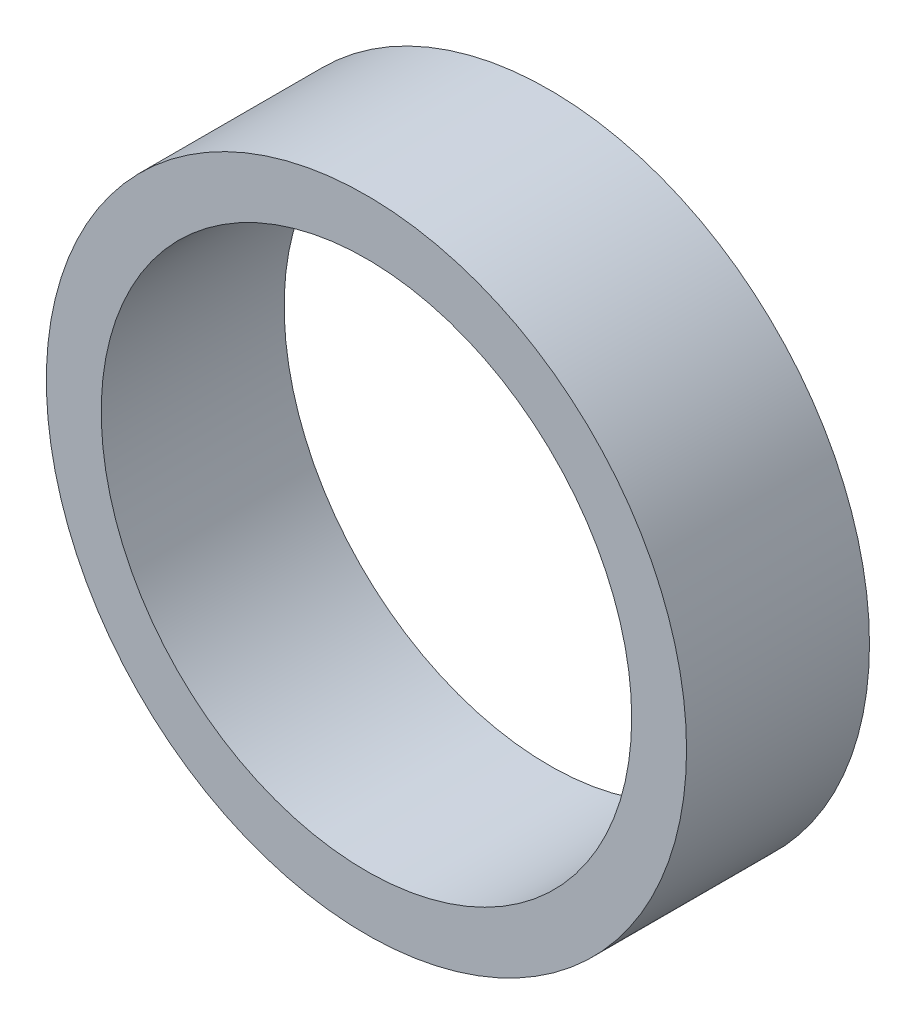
ISO-10303-21;
HEADER;
FILE_DESCRIPTION(('STEP AP214'),'2;1');
FILE_NAME('part.step','',(''),(''),'','','');
FILE_SCHEMA(('AUTOMOTIVE_DESIGN { 1 0 10303 214 1 1 1 1 }'));
ENDSEC;
DATA;
#1=APPLICATION_CONTEXT('core data for automotive mechanical design processes');
#2=APPLICATION_PROTOCOL_DEFINITION('international standard','automotive_design',2000,#1);
#3=PRODUCT_CONTEXT('',#1,'mechanical');
#4=PRODUCT('Part','Part','',(#3));
#5=PRODUCT_RELATED_PRODUCT_CATEGORY('part','',(#4));
#6=PRODUCT_DEFINITION_FORMATION('','',#4);
#7=PRODUCT_DEFINITION_CONTEXT('part definition',#1,'design');
#8=PRODUCT_DEFINITION('design','',#6,#7);
#9=PRODUCT_DEFINITION_SHAPE('','',#8);
#10=(LENGTH_UNIT() NAMED_UNIT(*) SI_UNIT(.MILLI.,.METRE.));
#11=(NAMED_UNIT(*) PLANE_ANGLE_UNIT() SI_UNIT($,.RADIAN.));
#12=(NAMED_UNIT(*) SI_UNIT($,.STERADIAN.) SOLID_ANGLE_UNIT());
#13=UNCERTAINTY_MEASURE_WITH_UNIT(LENGTH_MEASURE(1.E-05),#10,'distance_accuracy_value','');
#14=(GEOMETRIC_REPRESENTATION_CONTEXT(3) GLOBAL_UNCERTAINTY_ASSIGNED_CONTEXT((#13)) GLOBAL_UNIT_ASSIGNED_CONTEXT((#10,
#11,#12)) REPRESENTATION_CONTEXT('',''));
#15=CARTESIAN_POINT('',(0.,0.,0.));
#16=DIRECTION('',(0.,0.,1.));
#17=DIRECTION('',(1.,0.,0.));
#18=AXIS2_PLACEMENT_3D('',#15,#16,#17);
#19=CARTESIAN_POINT('',(0.,0.,12.7));
#20=DIRECTION('',(0.,0.,1.));
#21=DIRECTION('',(1.,0.,0.));
#22=AXIS2_PLACEMENT_3D('',#19,#20,#21);
#23=PLANE('',#22);
#24=CARTESIAN_POINT('',(0.,0.,12.7));
#25=DIRECTION('',(0.,0.,1.));
#26=DIRECTION('',(1.,0.,0.));
#27=AXIS2_PLACEMENT_3D('',#24,#25,#26);
#28=CIRCLE('',#27,44.4499615);
#29=CARTESIAN_POINT('',(44.4499615,0.,12.7));
#30=VERTEX_POINT('',#29);
#31=EDGE_CURVE('E10',#30,#30,#28,.T.);
#32=ORIENTED_EDGE('',*,*,#31,.T.);
#33=EDGE_LOOP('',(#32));
#34=FACE_BOUND('',#33,.T.);
#35=CARTESIAN_POINT('',(0.,0.,12.7));
#36=DIRECTION('',(0.,0.,1.));
#37=DIRECTION('',(1.,0.,0.));
#38=AXIS2_PLACEMENT_3D('',#35,#36,#37);
#39=CIRCLE('',#38,36.83);
#40=CARTESIAN_POINT('',(36.83,0.,12.7));
#41=VERTEX_POINT('',#40);
#42=EDGE_CURVE('E41',#41,#41,#39,.T.);
#43=ORIENTED_EDGE('',*,*,#42,.F.);
#44=EDGE_LOOP('',(#43));
#45=FACE_BOUND('',#44,.T.);
#46=ADVANCED_FACE('F30',(#34,#45),#23,.T.);
#47=CARTESIAN_POINT('',(0.,0.,-12.7));
#48=DIRECTION('',(0.,0.,1.));
#49=DIRECTION('',(1.,0.,0.));
#50=AXIS2_PLACEMENT_3D('',#47,#48,#49);
#51=PLANE('',#50);
#52=CARTESIAN_POINT('',(0.,0.,-12.7));
#53=DIRECTION('',(0.,0.,1.));
#54=DIRECTION('',(1.,0.,0.));
#55=AXIS2_PLACEMENT_3D('',#52,#53,#54);
#56=CIRCLE('',#55,44.4499615);
#57=CARTESIAN_POINT('',(44.4499615,0.,-12.7));
#58=VERTEX_POINT('',#57);
#59=EDGE_CURVE('E34',#58,#58,#56,.T.);
#60=ORIENTED_EDGE('',*,*,#59,.F.);
#61=EDGE_LOOP('',(#60));
#62=FACE_BOUND('',#61,.T.);
#63=CARTESIAN_POINT('',(0.,0.,-12.7));
#64=DIRECTION('',(0.,0.,1.));
#65=DIRECTION('',(1.,0.,0.));
#66=AXIS2_PLACEMENT_3D('',#63,#64,#65);
#67=CIRCLE('',#66,36.83);
#68=CARTESIAN_POINT('',(36.83,0.,-12.7));
#69=VERTEX_POINT('',#68);
#70=EDGE_CURVE('E43',#69,#69,#67,.T.);
#71=ORIENTED_EDGE('',*,*,#70,.T.);
#72=EDGE_LOOP('',(#71));
#73=FACE_BOUND('',#72,.T.);
#74=ADVANCED_FACE('F53',(#62,#73),#51,.F.);
#75=CARTESIAN_POINT('',(0.,0.,12.7));
#76=DIRECTION('',(0.,0.,-1.));
#77=DIRECTION('',(-1.,0.,0.));
#78=AXIS2_PLACEMENT_3D('',#75,#76,#77);
#79=CYLINDRICAL_SURFACE('',#78,44.4499615);
#80=ORIENTED_EDGE('',*,*,#31,.F.);
#81=EDGE_LOOP('',(#80));
#82=FACE_BOUND('',#81,.T.);
#83=ORIENTED_EDGE('',*,*,#59,.T.);
#84=EDGE_LOOP('',(#83));
#85=FACE_BOUND('',#84,.T.);
#86=ADVANCED_FACE('F32',(#82,#85),#79,.T.);
#87=CARTESIAN_POINT('',(0.,0.,12.7));
#88=DIRECTION('',(0.,0.,-1.));
#89=DIRECTION('',(-1.,0.,0.));
#90=AXIS2_PLACEMENT_3D('',#87,#88,#89);
#91=CYLINDRICAL_SURFACE('',#90,36.83);
#92=ORIENTED_EDGE('',*,*,#42,.T.);
#93=EDGE_LOOP('',(#92));
#94=FACE_BOUND('',#93,.T.);
#95=ORIENTED_EDGE('',*,*,#70,.F.);
#96=EDGE_LOOP('',(#95));
#97=FACE_BOUND('',#96,.T.);
#98=ADVANCED_FACE('F49',(#94,#97),#91,.F.);
#99=CLOSED_SHELL('',(#46,#74,#86,#98));
#100=MANIFOLD_SOLID_BREP('B2',#99);
#101=ADVANCED_BREP_SHAPE_REPRESENTATION('',(#18,#100),#14);
#102=SHAPE_DEFINITION_REPRESENTATION(#9,#101);
ENDSEC;
END-ISO-10303-21;
